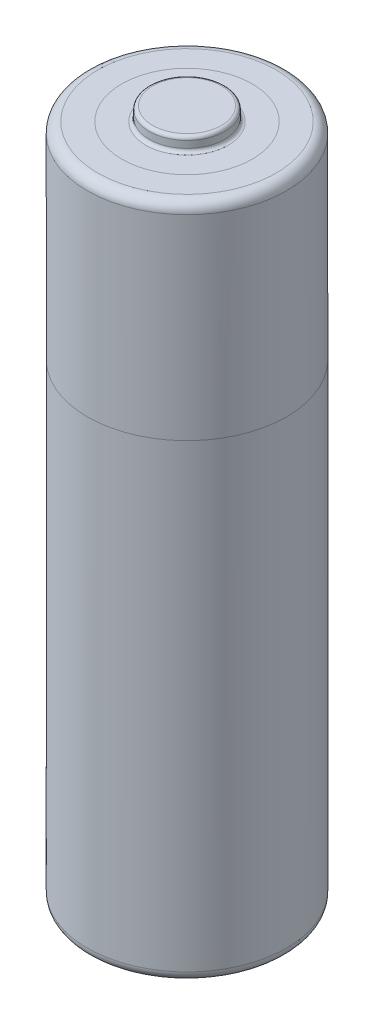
ISO-10303-21;
HEADER;
FILE_DESCRIPTION(('STEP AP214'),'2;1');
FILE_NAME('part.step','',(''),(''),'','','');
FILE_SCHEMA(('AUTOMOTIVE_DESIGN { 1 0 10303 214 1 1 1 1 }'));
ENDSEC;
DATA;
#1=APPLICATION_CONTEXT('core data for automotive mechanical design processes');
#2=APPLICATION_PROTOCOL_DEFINITION('international standard','automotive_design',2000,#1);
#3=PRODUCT_CONTEXT('',#1,'mechanical');
#4=PRODUCT('Part','Part','',(#3));
#5=PRODUCT_RELATED_PRODUCT_CATEGORY('part','',(#4));
#6=PRODUCT_DEFINITION_FORMATION('','',#4);
#7=PRODUCT_DEFINITION_CONTEXT('part definition',#1,'design');
#8=PRODUCT_DEFINITION('design','',#6,#7);
#9=PRODUCT_DEFINITION_SHAPE('','',#8);
#10=(LENGTH_UNIT() NAMED_UNIT(*) SI_UNIT(.MILLI.,.METRE.));
#11=(NAMED_UNIT(*) PLANE_ANGLE_UNIT() SI_UNIT($,.RADIAN.));
#12=(NAMED_UNIT(*) SI_UNIT($,.STERADIAN.) SOLID_ANGLE_UNIT());
#13=UNCERTAINTY_MEASURE_WITH_UNIT(LENGTH_MEASURE(1.E-05),#10,'distance_accuracy_value','');
#14=(GEOMETRIC_REPRESENTATION_CONTEXT(3) GLOBAL_UNCERTAINTY_ASSIGNED_CONTEXT((#13)) GLOBAL_UNIT_ASSIGNED_CONTEXT((#10,
#11,#12)) REPRESENTATION_CONTEXT('',''));
#15=CARTESIAN_POINT('',(0.,0.,0.));
#16=DIRECTION('',(0.,0.,1.));
#17=DIRECTION('',(1.,0.,0.));
#18=AXIS2_PLACEMENT_3D('',#15,#16,#17);
#19=CARTESIAN_POINT('',(0.,0.,0.));
#20=DIRECTION('',(0.,1.,0.));
#21=DIRECTION('',(0.,0.,1.));
#22=AXIS2_PLACEMENT_3D('',#19,#20,#21);
#23=CYLINDRICAL_SURFACE('',#22,7.25);
#24=CARTESIAN_POINT('',(0.,-48.5,0.));
#25=DIRECTION('',(0.,-1.,0.));
#26=DIRECTION('',(0.,0.,-1.));
#27=AXIS2_PLACEMENT_3D('',#24,#25,#26);
#28=CIRCLE('',#27,7.25);
#29=CARTESIAN_POINT('',(0.,-48.5,-7.25));
#30=VERTEX_POINT('',#29);
#31=EDGE_CURVE('E78',#30,#30,#28,.F.);
#32=ORIENTED_EDGE('',*,*,#31,.T.);
#33=EDGE_LOOP('',(#32));
#34=FACE_BOUND('',#33,.T.);
#35=CARTESIAN_POINT('',(0.,-15.,0.));
#36=DIRECTION('',(0.,1.,0.));
#37=DIRECTION('',(-1.,0.,0.));
#38=AXIS2_PLACEMENT_3D('',#35,#36,#37);
#39=CIRCLE('',#38,7.25);
#40=CARTESIAN_POINT('',(7.25,-15.,0.));
#41=VERTEX_POINT('',#40);
#42=CARTESIAN_POINT('',(-7.24999999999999,-15.,0.));
#43=VERTEX_POINT('',#42);
#44=EDGE_CURVE('E58',#41,#43,#39,.F.);
#45=ORIENTED_EDGE('',*,*,#44,.T.);
#46=EDGE_CURVE('E55',#43,#41,#39,.F.);
#47=ORIENTED_EDGE('',*,*,#46,.T.);
#48=EDGE_LOOP('',(#45,#47));
#49=FACE_BOUND('',#48,.T.);
#50=ADVANCED_FACE('F40',(#34,#49),#23,.T.);
#51=CARTESIAN_POINT('',(3.64433756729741,-49.25,0.));
#52=DIRECTION('',(0.,-1.,0.));
#53=DIRECTION('',(0.,0.,-1.));
#54=AXIS2_PLACEMENT_3D('',#51,#52,#53);
#55=PLANE('',#54);
#56=CARTESIAN_POINT('',(0.,-49.25,0.));
#57=DIRECTION('',(0.,-1.,0.));
#58=DIRECTION('',(0.,0.,-1.));
#59=AXIS2_PLACEMENT_3D('',#56,#57,#58);
#60=CIRCLE('',#59,6.5);
#61=CARTESIAN_POINT('',(0.,-49.25,-6.5));
#62=VERTEX_POINT('',#61);
#63=EDGE_CURVE('E81',#62,#62,#60,.T.);
#64=ORIENTED_EDGE('',*,*,#63,.T.);
#65=EDGE_LOOP('',(#64));
#66=FACE_BOUND('',#65,.T.);
#67=CARTESIAN_POINT('',(0.,-49.25,0.));
#68=DIRECTION('',(0.,-1.,0.));
#69=DIRECTION('',(0.,0.,-1.));
#70=AXIS2_PLACEMENT_3D('',#67,#68,#69);
#71=CIRCLE('',#70,4.75);
#72=CARTESIAN_POINT('',(0.,-49.25,-4.75));
#73=VERTEX_POINT('',#72);
#74=EDGE_CURVE('E64',#73,#73,#71,.F.);
#75=ORIENTED_EDGE('',*,*,#74,.T.);
#76=EDGE_LOOP('',(#75));
#77=FACE_BOUND('',#76,.T.);
#78=ADVANCED_FACE('F140',(#66,#77),#55,.T.);
#79=CARTESIAN_POINT('',(0.,0.,0.));
#80=DIRECTION('',(0.,1.,0.));
#81=DIRECTION('',(0.,0.,1.));
#82=AXIS2_PLACEMENT_3D('',#79,#80,#81);
#83=PLANE('',#82);
#84=CARTESIAN_POINT('',(0.,0.,0.));
#85=DIRECTION('',(0.,1.,0.));
#86=DIRECTION('',(0.,0.,1.));
#87=AXIS2_PLACEMENT_3D('',#84,#85,#86);
#88=CIRCLE('',#87,6.5);
#89=CARTESIAN_POINT('',(0.,0.,6.5));
#90=VERTEX_POINT('',#89);
#91=EDGE_CURVE('E60',#90,#90,#88,.T.);
#92=ORIENTED_EDGE('',*,*,#91,.T.);
#93=EDGE_LOOP('',(#92));
#94=FACE_BOUND('',#93,.T.);
#95=CARTESIAN_POINT('',(0.,0.,0.));
#96=DIRECTION('',(0.,1.,0.));
#97=DIRECTION('',(0.,0.,1.));
#98=AXIS2_PLACEMENT_3D('',#95,#96,#97);
#99=CIRCLE('',#98,4.75);
#100=CARTESIAN_POINT('',(0.,0.,4.75));
#101=VERTEX_POINT('',#100);
#102=EDGE_CURVE('E69',#101,#101,#99,.F.);
#103=ORIENTED_EDGE('',*,*,#102,.T.);
#104=EDGE_LOOP('',(#103));
#105=FACE_BOUND('',#104,.T.);
#106=ADVANCED_FACE('F113',(#94,#105),#83,.T.);
#107=CARTESIAN_POINT('',(0.,-0.75,0.));
#108=DIRECTION('',(0.,1.,0.));
#109=DIRECTION('',(0.,0.,1.));
#110=AXIS2_PLACEMENT_3D('',#107,#108,#109);
#111=CIRCLE('',#110,7.25);
#112=CARTESIAN_POINT('',(0.,-0.75,7.25));
#113=VERTEX_POINT('',#112);
#114=EDGE_CURVE('E75',#113,#113,#111,.F.);
#115=ORIENTED_EDGE('',*,*,#114,.T.);
#116=EDGE_LOOP('',(#115));
#117=FACE_BOUND('',#116,.T.);
#118=ORIENTED_EDGE('',*,*,#46,.F.);
#119=ORIENTED_EDGE('',*,*,#44,.F.);
#120=EDGE_LOOP('',(#118,#119));
#121=FACE_BOUND('',#120,.T.);
#122=ADVANCED_FACE('F62',(#117,#121),#23,.T.);
#123=CARTESIAN_POINT('',(0.,0.,0.));
#124=DIRECTION('',(0.,1.,0.));
#125=DIRECTION('',(0.,0.,1.));
#126=AXIS2_PLACEMENT_3D('',#123,#124,#125);
#127=CIRCLE('',#126,3.);
#128=CARTESIAN_POINT('',(0.,0.,3.));
#129=VERTEX_POINT('',#128);
#130=EDGE_CURVE('E90',#129,#129,#127,.F.);
#131=ORIENTED_EDGE('',*,*,#130,.T.);
#132=EDGE_LOOP('',(#131));
#133=FACE_BOUND('',#132,.T.);
#134=ORIENTED_EDGE('',*,*,#102,.F.);
#135=EDGE_LOOP('',(#134));
#136=FACE_BOUND('',#135,.T.);
#137=ADVANCED_FACE('F108',(#133,#136),#83,.T.);
#138=CARTESIAN_POINT('',(0.,0.999999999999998,0.));
#139=DIRECTION('',(0.,-1.,0.));
#140=DIRECTION('',(0.,0.,-1.));
#141=AXIS2_PLACEMENT_3D('',#138,#139,#140);
#142=PLANE('',#141);
#143=CARTESIAN_POINT('',(0.,0.999999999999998,0.));
#144=DIRECTION('',(0.,-1.,0.));
#145=DIRECTION('',(0.,0.,-1.));
#146=AXIS2_PLACEMENT_3D('',#143,#144,#145);
#147=CIRCLE('',#146,2.5);
#148=CARTESIAN_POINT('',(0.,0.999999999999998,-2.5));
#149=VERTEX_POINT('',#148);
#150=EDGE_CURVE('E12',#149,#149,#147,.F.);
#151=ORIENTED_EDGE('',*,*,#150,.T.);
#152=EDGE_LOOP('',(#151));
#153=FACE_BOUND('',#152,.T.);
#154=ADVANCED_FACE('F111',(#153),#142,.F.);
#155=CARTESIAN_POINT('',(0.,0.,0.));
#156=DIRECTION('',(0.,-1.,0.));
#157=DIRECTION('',(0.,0.,-1.));
#158=AXIS2_PLACEMENT_3D('',#155,#156,#157);
#159=CYLINDRICAL_SURFACE('',#158,2.75);
#160=CARTESIAN_POINT('',(0.,0.25,0.));
#161=DIRECTION('',(0.,1.,0.));
#162=DIRECTION('',(0.,0.,1.));
#163=AXIS2_PLACEMENT_3D('',#160,#161,#162);
#164=CIRCLE('',#163,2.75);
#165=CARTESIAN_POINT('',(0.,0.25,2.75));
#166=VERTEX_POINT('',#165);
#167=EDGE_CURVE('E49',#166,#166,#164,.T.);
#168=ORIENTED_EDGE('',*,*,#167,.T.);
#169=EDGE_LOOP('',(#168));
#170=FACE_BOUND('',#169,.T.);
#171=CARTESIAN_POINT('',(0.,0.749999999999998,0.));
#172=DIRECTION('',(0.,-1.,0.));
#173=DIRECTION('',(0.,0.,-1.));
#174=AXIS2_PLACEMENT_3D('',#171,#172,#173);
#175=CIRCLE('',#174,2.75);
#176=CARTESIAN_POINT('',(0.,0.749999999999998,-2.75));
#177=VERTEX_POINT('',#176);
#178=EDGE_CURVE('E93',#177,#177,#175,.T.);
#179=ORIENTED_EDGE('',*,*,#178,.T.);
#180=EDGE_LOOP('',(#179));
#181=FACE_BOUND('',#180,.T.);
#182=ADVANCED_FACE('F99',(#170,#181),#159,.T.);
#183=CARTESIAN_POINT('',(0.,-49.25,0.));
#184=DIRECTION('',(0.,-1.,0.));
#185=DIRECTION('',(0.,0.,-1.));
#186=AXIS2_PLACEMENT_3D('',#183,#184,#185);
#187=CIRCLE('',#186,3.78867513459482);
#188=CARTESIAN_POINT('',(0.,-49.25,-3.78867513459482));
#189=VERTEX_POINT('',#188);
#190=EDGE_CURVE('E84',#189,#189,#187,.F.);
#191=ORIENTED_EDGE('',*,*,#190,.T.);
#192=EDGE_LOOP('',(#191));
#193=FACE_BOUND('',#192,.T.);
#194=ORIENTED_EDGE('',*,*,#74,.F.);
#195=EDGE_LOOP('',(#194));
#196=FACE_BOUND('',#195,.T.);
#197=ADVANCED_FACE('F148',(#193,#196),#55,.T.);
#198=CARTESIAN_POINT('',(0.,-49.5,0.));
#199=DIRECTION('',(0.,-1.,0.));
#200=DIRECTION('',(0.,0.,-1.));
#201=AXIS2_PLACEMENT_3D('',#198,#199,#200);
#202=PLANE('',#201);
#203=CARTESIAN_POINT('',(0.,-49.5,0.));
#204=DIRECTION('',(0.,-1.,0.));
#205=DIRECTION('',(0.,0.,-1.));
#206=AXIS2_PLACEMENT_3D('',#203,#204,#205);
#207=CIRCLE('',#206,3.3556624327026);
#208=CARTESIAN_POINT('',(0.,-49.5,-3.3556624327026));
#209=VERTEX_POINT('',#208);
#210=EDGE_CURVE('E87',#209,#209,#207,.T.);
#211=ORIENTED_EDGE('',*,*,#210,.T.);
#212=EDGE_LOOP('',(#211));
#213=FACE_BOUND('',#212,.T.);
#214=ADVANCED_FACE('F160',(#213),#202,.T.);
#215=CARTESIAN_POINT('',(0.,-0.75,0.));
#216=DIRECTION('',(0.,1.,0.));
#217=DIRECTION('',(0.,0.,1.));
#218=AXIS2_PLACEMENT_3D('',#215,#216,#217);
#219=TOROIDAL_SURFACE('',#218,6.5,0.75);
#220=ORIENTED_EDGE('',*,*,#114,.F.);
#221=EDGE_LOOP('',(#220));
#222=FACE_BOUND('',#221,.T.);
#223=ORIENTED_EDGE('',*,*,#91,.F.);
#224=EDGE_LOOP('',(#223));
#225=FACE_BOUND('',#224,.T.);
#226=ADVANCED_FACE('F135',(#222,#225),#219,.T.);
#227=CARTESIAN_POINT('',(0.,-48.5,0.));
#228=DIRECTION('',(0.,-1.,0.));
#229=DIRECTION('',(0.,0.,-1.));
#230=AXIS2_PLACEMENT_3D('',#227,#228,#229);
#231=TOROIDAL_SURFACE('',#230,6.5,0.75);
#232=ORIENTED_EDGE('',*,*,#63,.F.);
#233=EDGE_LOOP('',(#232));
#234=FACE_BOUND('',#233,.T.);
#235=ORIENTED_EDGE('',*,*,#31,.F.);
#236=EDGE_LOOP('',(#235));
#237=FACE_BOUND('',#236,.T.);
#238=ADVANCED_FACE('F127',(#234,#237),#231,.T.);
#239=CARTESIAN_POINT('',(0.,-49.25,0.));
#240=DIRECTION('',(0.,-1.,0.));
#241=DIRECTION('',(0.,0.,-1.));
#242=AXIS2_PLACEMENT_3D('',#239,#240,#241);
#243=TOROIDAL_SURFACE('',#242,3.3556624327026,0.25);
#244=ORIENTED_EDGE('',*,*,#210,.F.);
#245=EDGE_LOOP('',(#244));
#246=FACE_BOUND('',#245,.T.);
#247=CARTESIAN_POINT('',(0.,-49.375,0.));
#248=DIRECTION('',(0.,-1.,0.));
#249=DIRECTION('',(0.,0.,-1.));
#250=AXIS2_PLACEMENT_3D('',#247,#248,#249);
#251=CIRCLE('',#250,3.57216878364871);
#252=CARTESIAN_POINT('',(0.,-49.375,-3.57216878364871));
#253=VERTEX_POINT('',#252);
#254=EDGE_CURVE('E44',#253,#253,#251,.F.);
#255=ORIENTED_EDGE('',*,*,#254,.F.);
#256=EDGE_LOOP('',(#255));
#257=FACE_BOUND('',#256,.T.);
#258=ADVANCED_FACE('F125',(#246,#257),#243,.T.);
#259=CARTESIAN_POINT('',(0.,-49.5,0.));
#260=DIRECTION('',(0.,-1.,0.));
#261=DIRECTION('',(0.,0.,-1.));
#262=AXIS2_PLACEMENT_3D('',#259,#260,#261);
#263=TOROIDAL_SURFACE('',#262,3.78867513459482,0.25);
#264=ORIENTED_EDGE('',*,*,#254,.T.);
#265=EDGE_LOOP('',(#264));
#266=FACE_BOUND('',#265,.T.);
#267=ORIENTED_EDGE('',*,*,#190,.F.);
#268=EDGE_LOOP('',(#267));
#269=FACE_BOUND('',#268,.T.);
#270=ADVANCED_FACE('F105',(#266,#269),#263,.F.);
#271=CARTESIAN_POINT('',(0.,0.25,0.));
#272=DIRECTION('',(0.,1.,0.));
#273=DIRECTION('',(0.,0.,1.));
#274=AXIS2_PLACEMENT_3D('',#271,#272,#273);
#275=TOROIDAL_SURFACE('',#274,3.,0.25);
#276=ORIENTED_EDGE('',*,*,#167,.F.);
#277=EDGE_LOOP('',(#276));
#278=FACE_BOUND('',#277,.T.);
#279=ORIENTED_EDGE('',*,*,#130,.F.);
#280=EDGE_LOOP('',(#279));
#281=FACE_BOUND('',#280,.T.);
#282=ADVANCED_FACE('F102',(#278,#281),#275,.F.);
#283=CARTESIAN_POINT('',(0.,0.749999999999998,0.));
#284=DIRECTION('',(0.,-1.,0.));
#285=DIRECTION('',(0.,0.,-1.));
#286=AXIS2_PLACEMENT_3D('',#283,#284,#285);
#287=TOROIDAL_SURFACE('',#286,2.5,0.25);
#288=ORIENTED_EDGE('',*,*,#150,.F.);
#289=EDGE_LOOP('',(#288));
#290=FACE_BOUND('',#289,.T.);
#291=ORIENTED_EDGE('',*,*,#178,.F.);
#292=EDGE_LOOP('',(#291));
#293=FACE_BOUND('',#292,.T.);
#294=ADVANCED_FACE('F42',(#290,#293),#287,.T.);
#295=CLOSED_SHELL('',(#50,#78,#106,#122,#137,#154,#182,#197,#214,#226,#238,#258,#270,#282,#294));
#296=MANIFOLD_SOLID_BREP('B2',#295);
#297=ADVANCED_BREP_SHAPE_REPRESENTATION('',(#18,#296),#14);
#298=SHAPE_DEFINITION_REPRESENTATION(#9,#297);
ENDSEC;
END-ISO-10303-21;
